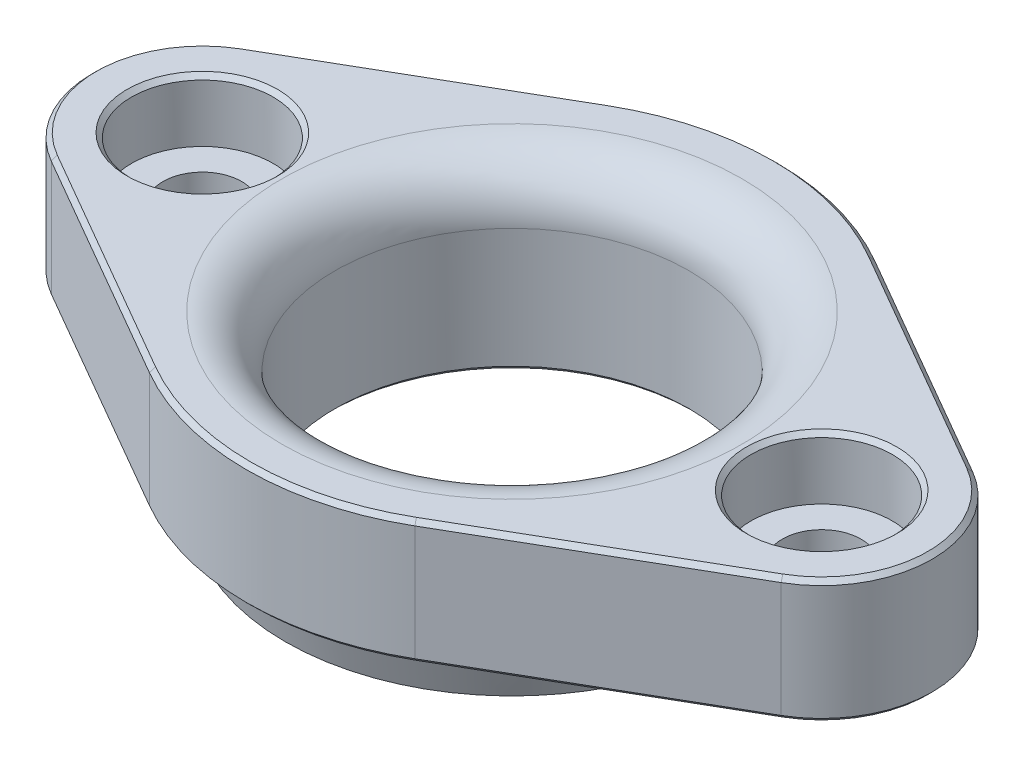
ISO-10303-21;
HEADER;
FILE_DESCRIPTION(('STEP AP214'),'2;1');
FILE_NAME('part.step','',(''),(''),'','','');
FILE_SCHEMA(('AUTOMOTIVE_DESIGN { 1 0 10303 214 1 1 1 1 }'));
ENDSEC;
DATA;
#1=APPLICATION_CONTEXT('core data for automotive mechanical design processes');
#2=APPLICATION_PROTOCOL_DEFINITION('international standard','automotive_design',2000,#1);
#3=PRODUCT_CONTEXT('',#1,'mechanical');
#4=PRODUCT('Part','Part','',(#3));
#5=PRODUCT_RELATED_PRODUCT_CATEGORY('part','',(#4));
#6=PRODUCT_DEFINITION_FORMATION('','',#4);
#7=PRODUCT_DEFINITION_CONTEXT('part definition',#1,'design');
#8=PRODUCT_DEFINITION('design','',#6,#7);
#9=PRODUCT_DEFINITION_SHAPE('','',#8);
#10=(LENGTH_UNIT() NAMED_UNIT(*) SI_UNIT(.MILLI.,.METRE.));
#11=(NAMED_UNIT(*) PLANE_ANGLE_UNIT() SI_UNIT($,.RADIAN.));
#12=(NAMED_UNIT(*) SI_UNIT($,.STERADIAN.) SOLID_ANGLE_UNIT());
#13=UNCERTAINTY_MEASURE_WITH_UNIT(LENGTH_MEASURE(1.E-05),#10,'distance_accuracy_value','');
#14=(GEOMETRIC_REPRESENTATION_CONTEXT(3) GLOBAL_UNCERTAINTY_ASSIGNED_CONTEXT((#13)) GLOBAL_UNIT_ASSIGNED_CONTEXT((#10,
#11,#12)) REPRESENTATION_CONTEXT('',''));
#15=CARTESIAN_POINT('',(0.,0.,0.));
#16=DIRECTION('',(0.,0.,1.));
#17=DIRECTION('',(1.,0.,0.));
#18=AXIS2_PLACEMENT_3D('',#15,#16,#17);
#19=CARTESIAN_POINT('',(-5.08,5.08,0.));
#20=DIRECTION('',(0.,-1.,0.));
#21=DIRECTION('',(0.,0.,-1.));
#22=AXIS2_PLACEMENT_3D('',#19,#20,#21);
#23=PLANE('',#22);
#24=CARTESIAN_POINT('',(0.,5.08,0.));
#25=DIRECTION('',(0.,-1.,0.));
#26=DIRECTION('',(0.,0.,-1.));
#27=AXIS2_PLACEMENT_3D('',#24,#25,#26);
#28=CIRCLE('',#27,7.493);
#29=CARTESIAN_POINT('',(-3.7465,5.08,6.4891283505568));
#30=VERTEX_POINT('',#29);
#31=CARTESIAN_POINT('',(3.7465,5.08,6.4891283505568));
#32=VERTEX_POINT('',#31);
#33=EDGE_CURVE('E61',#30,#32,#28,.F.);
#34=ORIENTED_EDGE('',*,*,#33,.T.);
#35=DIRECTION('',(0.866025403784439,0.,-0.5));
#36=VECTOR('',#35,1.);
#37=CARTESIAN_POINT('',(10.414,5.08,2.63964543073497));
#38=LINE('',#37,#36);
#39=CARTESIAN_POINT('',(10.414,5.08,2.63964543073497));
#40=VERTEX_POINT('',#39);
#41=EDGE_CURVE('E313',#32,#40,#38,.T.);
#42=ORIENTED_EDGE('',*,*,#41,.T.);
#43=CARTESIAN_POINT('',(8.89,5.08,0.));
#44=DIRECTION('',(0.,-1.,0.));
#45=DIRECTION('',(0.,0.,-1.));
#46=AXIS2_PLACEMENT_3D('',#43,#44,#45);
#47=CIRCLE('',#46,3.048);
#48=CARTESIAN_POINT('',(10.414,5.08,-2.63964543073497));
#49=VERTEX_POINT('',#48);
#50=EDGE_CURVE('E294',#40,#49,#47,.F.);
#51=ORIENTED_EDGE('',*,*,#50,.T.);
#52=DIRECTION('',(-0.866025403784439,0.,-0.5));
#53=VECTOR('',#52,1.);
#54=CARTESIAN_POINT('',(3.7465,5.08,-6.4891283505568));
#55=LINE('',#54,#53);
#56=CARTESIAN_POINT('',(3.7465,5.08,-6.4891283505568));
#57=VERTEX_POINT('',#56);
#58=EDGE_CURVE('E297',#49,#57,#55,.T.);
#59=ORIENTED_EDGE('',*,*,#58,.T.);
#60=CARTESIAN_POINT('',(0.,5.08,0.));
#61=DIRECTION('',(0.,-1.,0.));
#62=DIRECTION('',(0.,0.,-1.));
#63=AXIS2_PLACEMENT_3D('',#60,#61,#62);
#64=CIRCLE('',#63,7.493);
#65=CARTESIAN_POINT('',(-3.7465,5.08,-6.4891283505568));
#66=VERTEX_POINT('',#65);
#67=EDGE_CURVE('E300',#57,#66,#64,.F.);
#68=ORIENTED_EDGE('',*,*,#67,.T.);
#69=DIRECTION('',(-0.866025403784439,0.,0.5));
#70=VECTOR('',#69,1.);
#71=CARTESIAN_POINT('',(-10.414,5.08,-2.63964543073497));
#72=LINE('',#71,#70);
#73=CARTESIAN_POINT('',(-10.414,5.08,-2.63964543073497));
#74=VERTEX_POINT('',#73);
#75=EDGE_CURVE('E303',#66,#74,#72,.T.);
#76=ORIENTED_EDGE('',*,*,#75,.T.);
#77=CARTESIAN_POINT('',(-8.89,5.08,0.));
#78=DIRECTION('',(0.,-1.,0.));
#79=DIRECTION('',(0.,0.,-1.));
#80=AXIS2_PLACEMENT_3D('',#77,#78,#79);
#81=CIRCLE('',#80,3.048);
#82=CARTESIAN_POINT('',(-10.414,5.08,2.63964543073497));
#83=VERTEX_POINT('',#82);
#84=EDGE_CURVE('E306',#74,#83,#81,.F.);
#85=ORIENTED_EDGE('',*,*,#84,.T.);
#86=DIRECTION('',(0.866025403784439,0.,0.5));
#87=VECTOR('',#86,1.);
#88=CARTESIAN_POINT('',(-3.7465,5.08,6.4891283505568));
#89=LINE('',#88,#87);
#90=EDGE_CURVE('E66',#83,#30,#89,.T.);
#91=ORIENTED_EDGE('',*,*,#90,.T.);
#92=EDGE_LOOP('',(#34,#42,#51,#59,#68,#76,#85,#91));
#93=FACE_BOUND('',#92,.T.);
#94=CARTESIAN_POINT('',(-8.89,5.08,0.));
#95=DIRECTION('',(0.,-1.,0.));
#96=DIRECTION('',(0.,0.,-1.));
#97=AXIS2_PLACEMENT_3D('',#94,#95,#96);
#98=CIRCLE('',#97,2.159);
#99=CARTESIAN_POINT('',(-8.89,5.08,-2.159));
#100=VERTEX_POINT('',#99);
#101=EDGE_CURVE('E290',#100,#100,#98,.T.);
#102=ORIENTED_EDGE('',*,*,#101,.T.);
#103=EDGE_LOOP('',(#102));
#104=FACE_BOUND('',#103,.T.);
#105=CARTESIAN_POINT('',(8.89,5.08,0.));
#106=DIRECTION('',(0.,-1.,0.));
#107=DIRECTION('',(0.,0.,-1.));
#108=AXIS2_PLACEMENT_3D('',#105,#106,#107);
#109=CIRCLE('',#108,2.159);
#110=CARTESIAN_POINT('',(8.89,5.08,-2.159));
#111=VERTEX_POINT('',#110);
#112=EDGE_CURVE('E286',#111,#111,#109,.T.);
#113=ORIENTED_EDGE('',*,*,#112,.T.);
#114=EDGE_LOOP('',(#113));
#115=FACE_BOUND('',#114,.T.);
#116=CARTESIAN_POINT('',(0.,5.08,0.));
#117=DIRECTION('',(0.,-1.,0.));
#118=DIRECTION('',(0.,0.,-1.));
#119=AXIS2_PLACEMENT_3D('',#116,#117,#118);
#120=CIRCLE('',#119,6.604);
#121=CARTESIAN_POINT('',(0.,5.08,-6.604));
#122=VERTEX_POINT('',#121);
#123=EDGE_CURVE('E432',#122,#122,#120,.T.);
#124=ORIENTED_EDGE('',*,*,#123,.T.);
#125=EDGE_LOOP('',(#124));
#126=FACE_BOUND('',#125,.T.);
#127=ADVANCED_FACE('F43',(#93,#104,#115,#126),#23,.F.);
#128=CARTESIAN_POINT('',(-12.065,1.524,0.));
#129=DIRECTION('',(0.,1.,0.));
#130=DIRECTION('',(0.,0.,1.));
#131=AXIS2_PLACEMENT_3D('',#128,#129,#130);
#132=PLANE('',#131);
#133=DIRECTION('',(0.866025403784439,0.,0.5));
#134=VECTOR('',#133,1.);
#135=CARTESIAN_POINT('',(10.414,1.524,-2.63964543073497));
#136=LINE('',#135,#134);
#137=CARTESIAN_POINT('',(3.7465,1.524,-6.4891283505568));
#138=VERTEX_POINT('',#137);
#139=CARTESIAN_POINT('',(10.414,1.524,-2.63964543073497));
#140=VERTEX_POINT('',#139);
#141=EDGE_CURVE('E235',#138,#140,#136,.T.);
#142=ORIENTED_EDGE('',*,*,#141,.T.);
#143=CARTESIAN_POINT('',(8.89,1.524,0.));
#144=DIRECTION('',(0.,1.,0.));
#145=DIRECTION('',(0.,0.,1.));
#146=AXIS2_PLACEMENT_3D('',#143,#144,#145);
#147=CIRCLE('',#146,3.048);
#148=CARTESIAN_POINT('',(10.414,1.524,2.63964543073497));
#149=VERTEX_POINT('',#148);
#150=EDGE_CURVE('E238',#140,#149,#147,.F.);
#151=ORIENTED_EDGE('',*,*,#150,.T.);
#152=DIRECTION('',(-0.866025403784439,0.,0.5));
#153=VECTOR('',#152,1.);
#154=CARTESIAN_POINT('',(3.7465,1.524,6.4891283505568));
#155=LINE('',#154,#153);
#156=CARTESIAN_POINT('',(3.7465,1.524,6.4891283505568));
#157=VERTEX_POINT('',#156);
#158=EDGE_CURVE('E191',#149,#157,#155,.T.);
#159=ORIENTED_EDGE('',*,*,#158,.T.);
#160=CARTESIAN_POINT('',(0.,1.524,0.));
#161=DIRECTION('',(0.,1.,0.));
#162=DIRECTION('',(0.,0.,1.));
#163=AXIS2_PLACEMENT_3D('',#160,#161,#162);
#164=CIRCLE('',#163,7.493);
#165=CARTESIAN_POINT('',(-3.7465,1.524,6.4891283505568));
#166=VERTEX_POINT('',#165);
#167=EDGE_CURVE('E220',#157,#166,#164,.F.);
#168=ORIENTED_EDGE('',*,*,#167,.T.);
#169=DIRECTION('',(-0.866025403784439,0.,-0.5));
#170=VECTOR('',#169,1.);
#171=CARTESIAN_POINT('',(-10.414,1.524,2.63964543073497));
#172=LINE('',#171,#170);
#173=CARTESIAN_POINT('',(-10.414,1.524,2.63964543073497));
#174=VERTEX_POINT('',#173);
#175=EDGE_CURVE('E223',#166,#174,#172,.T.);
#176=ORIENTED_EDGE('',*,*,#175,.T.);
#177=CARTESIAN_POINT('',(-8.89,1.524,0.));
#178=DIRECTION('',(0.,1.,0.));
#179=DIRECTION('',(0.,0.,1.));
#180=AXIS2_PLACEMENT_3D('',#177,#178,#179);
#181=CIRCLE('',#180,3.048);
#182=CARTESIAN_POINT('',(-10.414,1.524,-2.63964543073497));
#183=VERTEX_POINT('',#182);
#184=EDGE_CURVE('E226',#174,#183,#181,.F.);
#185=ORIENTED_EDGE('',*,*,#184,.T.);
#186=DIRECTION('',(0.866025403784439,0.,-0.5));
#187=VECTOR('',#186,1.);
#188=CARTESIAN_POINT('',(-3.7465,1.524,-6.4891283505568));
#189=LINE('',#188,#187);
#190=CARTESIAN_POINT('',(-3.7465,1.524,-6.4891283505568));
#191=VERTEX_POINT('',#190);
#192=EDGE_CURVE('E229',#183,#191,#189,.T.);
#193=ORIENTED_EDGE('',*,*,#192,.T.);
#194=CARTESIAN_POINT('',(0.,1.524,0.));
#195=DIRECTION('',(0.,1.,0.));
#196=DIRECTION('',(0.,0.,1.));
#197=AXIS2_PLACEMENT_3D('',#194,#195,#196);
#198=CIRCLE('',#197,7.493);
#199=EDGE_CURVE('E232',#191,#138,#198,.F.);
#200=ORIENTED_EDGE('',*,*,#199,.T.);
#201=EDGE_LOOP('',(#142,#151,#159,#168,#176,#185,#193,#200));
#202=FACE_BOUND('',#201,.T.);
#203=CARTESIAN_POINT('',(-8.89,1.524,0.));
#204=DIRECTION('',(0.,1.,0.));
#205=DIRECTION('',(0.,0.,1.));
#206=AXIS2_PLACEMENT_3D('',#203,#204,#205);
#207=CIRCLE('',#206,1.2573);
#208=CARTESIAN_POINT('',(-8.89,1.524,1.2573));
#209=VERTEX_POINT('',#208);
#210=EDGE_CURVE('E208',#209,#209,#207,.T.);
#211=ORIENTED_EDGE('',*,*,#210,.T.);
#212=EDGE_LOOP('',(#211));
#213=FACE_BOUND('',#212,.T.);
#214=CARTESIAN_POINT('',(8.89,1.524,0.));
#215=DIRECTION('',(0.,1.,0.));
#216=DIRECTION('',(0.,0.,1.));
#217=AXIS2_PLACEMENT_3D('',#214,#215,#216);
#218=CIRCLE('',#217,1.2573);
#219=CARTESIAN_POINT('',(8.89,1.524,1.2573));
#220=VERTEX_POINT('',#219);
#221=EDGE_CURVE('E203',#220,#220,#218,.T.);
#222=ORIENTED_EDGE('',*,*,#221,.T.);
#223=EDGE_LOOP('',(#222));
#224=FACE_BOUND('',#223,.T.);
#225=CARTESIAN_POINT('',(0.,1.524,0.));
#226=DIRECTION('',(0.,1.,0.));
#227=DIRECTION('',(0.,0.,1.));
#228=AXIS2_PLACEMENT_3D('',#225,#226,#227);
#229=CIRCLE('',#228,7.27515667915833);
#230=CARTESIAN_POINT('',(0.,1.524,7.27515667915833));
#231=VERTEX_POINT('',#230);
#232=EDGE_CURVE('E428',#231,#231,#229,.T.);
#233=ORIENTED_EDGE('',*,*,#232,.T.);
#234=EDGE_LOOP('',(#233));
#235=FACE_BOUND('',#234,.T.);
#236=ADVANCED_FACE('F477',(#202,#213,#224,#235),#132,.F.);
#237=CARTESIAN_POINT('',(-6.477,0.,0.));
#238=DIRECTION('',(0.,1.,0.));
#239=DIRECTION('',(0.,0.,1.));
#240=AXIS2_PLACEMENT_3D('',#237,#238,#239);
#241=PLANE('',#240);
#242=CARTESIAN_POINT('',(0.,0.,0.));
#243=DIRECTION('',(0.,1.,0.));
#244=DIRECTION('',(0.,0.,1.));
#245=AXIS2_PLACEMENT_3D('',#242,#243,#244);
#246=CIRCLE('',#245,6.29739487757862);
#247=CARTESIAN_POINT('',(0.,0.,6.29739487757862));
#248=VERTEX_POINT('',#247);
#249=EDGE_CURVE('E444',#248,#248,#246,.F.);
#250=ORIENTED_EDGE('',*,*,#249,.T.);
#251=EDGE_LOOP('',(#250));
#252=FACE_BOUND('',#251,.T.);
#253=CARTESIAN_POINT('',(0.,0.,0.));
#254=DIRECTION('',(0.,1.,0.));
#255=DIRECTION('',(0.,0.,1.));
#256=AXIS2_PLACEMENT_3D('',#253,#254,#255);
#257=CIRCLE('',#256,5.20699999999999);
#258=CARTESIAN_POINT('',(0.,0.,5.20699999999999));
#259=VERTEX_POINT('',#258);
#260=EDGE_CURVE('E440',#259,#259,#257,.T.);
#261=ORIENTED_EDGE('',*,*,#260,.T.);
#262=EDGE_LOOP('',(#261));
#263=FACE_BOUND('',#262,.T.);
#264=ADVANCED_FACE('F482',(#252,#263),#241,.F.);
#265=CARTESIAN_POINT('',(0.,0.,0.));
#266=DIRECTION('',(0.,-1.,0.));
#267=DIRECTION('',(0.,0.,-1.));
#268=AXIS2_PLACEMENT_3D('',#265,#266,#267);
#269=CYLINDRICAL_SURFACE('',#268,5.08);
#270=CARTESIAN_POINT('',(0.,0.126999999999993,0.));
#271=DIRECTION('',(0.,1.,0.));
#272=DIRECTION('',(0.,0.,1.));
#273=AXIS2_PLACEMENT_3D('',#270,#271,#272);
#274=CIRCLE('',#273,5.08);
#275=CARTESIAN_POINT('',(0.,0.126999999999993,5.08));
#276=VERTEX_POINT('',#275);
#277=EDGE_CURVE('E211',#276,#276,#274,.F.);
#278=ORIENTED_EDGE('',*,*,#277,.T.);
#279=EDGE_LOOP('',(#278));
#280=FACE_BOUND('',#279,.T.);
#281=CARTESIAN_POINT('',(0.,3.556,0.));
#282=DIRECTION('',(0.,-1.,0.));
#283=DIRECTION('',(0.,0.,-1.));
#284=AXIS2_PLACEMENT_3D('',#281,#282,#283);
#285=CIRCLE('',#284,5.08);
#286=CARTESIAN_POINT('',(0.,3.556,-5.08));
#287=VERTEX_POINT('',#286);
#288=EDGE_CURVE('E436',#287,#287,#285,.F.);
#289=ORIENTED_EDGE('',*,*,#288,.T.);
#290=EDGE_LOOP('',(#289));
#291=FACE_BOUND('',#290,.T.);
#292=ADVANCED_FACE('F455',(#280,#291),#269,.F.);
#293=CARTESIAN_POINT('',(0.,1.524,0.));
#294=DIRECTION('',(0.,1.,0.));
#295=DIRECTION('',(0.,0.,1.));
#296=AXIS2_PLACEMENT_3D('',#293,#294,#295);
#297=CONICAL_SURFACE('',#296,6.88535456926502,0.261799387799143);
#298=CARTESIAN_POINT('',(0.,0.122672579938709,0.));
#299=DIRECTION('',(0.,-1.,0.));
#300=DIRECTION('',(0.,0.,-1.));
#301=AXIS2_PLACEMENT_3D('',#298,#299,#300);
#302=CIRCLE('',#301,6.50987001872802);
#303=CARTESIAN_POINT('',(0.,0.122672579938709,-6.50987001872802));
#304=VERTEX_POINT('',#303);
#305=EDGE_CURVE('E448',#304,#304,#302,.F.);
#306=ORIENTED_EDGE('',*,*,#305,.T.);
#307=EDGE_LOOP('',(#306));
#308=FACE_BOUND('',#307,.T.);
#309=CARTESIAN_POINT('',(0.,1.14748007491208,0.));
#310=DIRECTION('',(0.,1.,0.));
#311=DIRECTION('',(0.,0.,1.));
#312=AXIS2_PLACEMENT_3D('',#309,#310,#311);
#313=CIRCLE('',#312,6.78446635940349);
#314=CARTESIAN_POINT('',(0.,1.14748007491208,6.78446635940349));
#315=VERTEX_POINT('',#314);
#316=EDGE_CURVE('E424',#315,#315,#313,.F.);
#317=ORIENTED_EDGE('',*,*,#316,.T.);
#318=EDGE_LOOP('',(#317));
#319=FACE_BOUND('',#318,.T.);
#320=ADVANCED_FACE('F490',(#308,#319),#297,.T.);
#321=CARTESIAN_POINT('',(0.,1.016,0.));
#322=DIRECTION('',(0.,1.,0.));
#323=DIRECTION('',(0.,0.,1.));
#324=AXIS2_PLACEMENT_3D('',#321,#322,#323);
#325=TOROIDAL_SURFACE('',#324,7.27515667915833,0.508);
#326=ORIENTED_EDGE('',*,*,#232,.F.);
#327=EDGE_LOOP('',(#326));
#328=FACE_BOUND('',#327,.T.);
#329=ORIENTED_EDGE('',*,*,#316,.F.);
#330=EDGE_LOOP('',(#329));
#331=FACE_BOUND('',#330,.T.);
#332=ADVANCED_FACE('F494',(#328,#331),#325,.F.);
#333=CARTESIAN_POINT('',(0.,3.556,0.));
#334=DIRECTION('',(0.,-1.,0.));
#335=DIRECTION('',(0.,0.,-1.));
#336=AXIS2_PLACEMENT_3D('',#333,#334,#335);
#337=TOROIDAL_SURFACE('',#336,6.604,1.524);
#338=ORIENTED_EDGE('',*,*,#288,.F.);
#339=EDGE_LOOP('',(#338));
#340=FACE_BOUND('',#339,.T.);
#341=ORIENTED_EDGE('',*,*,#123,.F.);
#342=EDGE_LOOP('',(#341));
#343=FACE_BOUND('',#342,.T.);
#344=ADVANCED_FACE('F497',(#340,#343),#337,.T.);
#345=CARTESIAN_POINT('',(-8.89,5.08,0.));
#346=DIRECTION('',(0.,1.,0.));
#347=DIRECTION('',(0.,0.,1.));
#348=AXIS2_PLACEMENT_3D('',#345,#346,#347);
#349=CYLINDRICAL_SURFACE('',#348,1.1303);
#350=CARTESIAN_POINT('',(-8.89,1.651,0.));
#351=DIRECTION('',(0.,1.,0.));
#352=DIRECTION('',(0.,0.,1.));
#353=AXIS2_PLACEMENT_3D('',#350,#351,#352);
#354=CIRCLE('',#353,1.1303);
#355=CARTESIAN_POINT('',(-8.89,1.651,1.1303));
#356=VERTEX_POINT('',#355);
#357=EDGE_CURVE('E173',#356,#356,#354,.F.);
#358=ORIENTED_EDGE('',*,*,#357,.T.);
#359=EDGE_LOOP('',(#358));
#360=FACE_BOUND('',#359,.T.);
#361=CARTESIAN_POINT('',(-8.89,3.302,0.));
#362=DIRECTION('',(0.,1.,0.));
#363=DIRECTION('',(0.,0.,1.));
#364=AXIS2_PLACEMENT_3D('',#361,#362,#363);
#365=CIRCLE('',#364,1.1303);
#366=CARTESIAN_POINT('',(-8.89,3.302,1.1303));
#367=VERTEX_POINT('',#366);
#368=EDGE_CURVE('E420',#367,#367,#365,.T.);
#369=ORIENTED_EDGE('',*,*,#368,.T.);
#370=EDGE_LOOP('',(#369));
#371=FACE_BOUND('',#370,.T.);
#372=ADVANCED_FACE('F500',(#360,#371),#349,.F.);
#373=CARTESIAN_POINT('',(-7.7597,3.302,0.));
#374=DIRECTION('',(0.,-1.,0.));
#375=DIRECTION('',(0.,0.,-1.));
#376=AXIS2_PLACEMENT_3D('',#373,#374,#375);
#377=PLANE('',#376);
#378=ORIENTED_EDGE('',*,*,#368,.F.);
#379=EDGE_LOOP('',(#378));
#380=FACE_BOUND('',#379,.T.);
#381=CARTESIAN_POINT('',(-8.89,3.302,0.));
#382=DIRECTION('',(0.,1.,0.));
#383=DIRECTION('',(0.,0.,1.));
#384=AXIS2_PLACEMENT_3D('',#381,#382,#383);
#385=CIRCLE('',#384,2.032);
#386=CARTESIAN_POINT('',(-8.89,3.302,2.032));
#387=VERTEX_POINT('',#386);
#388=EDGE_CURVE('E416',#387,#387,#385,.T.);
#389=ORIENTED_EDGE('',*,*,#388,.T.);
#390=EDGE_LOOP('',(#389));
#391=FACE_BOUND('',#390,.T.);
#392=ADVANCED_FACE('F505',(#380,#391),#377,.F.);
#393=CARTESIAN_POINT('',(-8.89,5.08,0.));
#394=DIRECTION('',(0.,1.,0.));
#395=DIRECTION('',(0.,0.,1.));
#396=AXIS2_PLACEMENT_3D('',#393,#394,#395);
#397=CYLINDRICAL_SURFACE('',#396,2.032);
#398=CARTESIAN_POINT('',(-8.89,4.953,0.));
#399=DIRECTION('',(0.,-1.,0.));
#400=DIRECTION('',(0.,0.,-1.));
#401=AXIS2_PLACEMENT_3D('',#398,#399,#400);
#402=CIRCLE('',#401,2.032);
#403=CARTESIAN_POINT('',(-8.89,4.953,-2.032));
#404=VERTEX_POINT('',#403);
#405=EDGE_CURVE('E53',#404,#404,#402,.F.);
#406=ORIENTED_EDGE('',*,*,#405,.T.);
#407=EDGE_LOOP('',(#406));
#408=FACE_BOUND('',#407,.T.);
#409=ORIENTED_EDGE('',*,*,#388,.F.);
#410=EDGE_LOOP('',(#409));
#411=FACE_BOUND('',#410,.T.);
#412=ADVANCED_FACE('F515',(#408,#411),#397,.F.);
#413=CARTESIAN_POINT('',(8.89,5.08,0.));
#414=DIRECTION('',(0.,1.,0.));
#415=DIRECTION('',(0.,0.,1.));
#416=AXIS2_PLACEMENT_3D('',#413,#414,#415);
#417=CYLINDRICAL_SURFACE('',#416,1.1303);
#418=CARTESIAN_POINT('',(8.89,1.651,0.));
#419=DIRECTION('',(0.,1.,0.));
#420=DIRECTION('',(0.,0.,1.));
#421=AXIS2_PLACEMENT_3D('',#418,#419,#420);
#422=CIRCLE('',#421,1.1303);
#423=CARTESIAN_POINT('',(8.89,1.651,1.1303));
#424=VERTEX_POINT('',#423);
#425=EDGE_CURVE('E282',#424,#424,#422,.F.);
#426=ORIENTED_EDGE('',*,*,#425,.T.);
#427=EDGE_LOOP('',(#426));
#428=FACE_BOUND('',#427,.T.);
#429=CARTESIAN_POINT('',(8.89,3.302,0.));
#430=DIRECTION('',(0.,1.,0.));
#431=DIRECTION('',(0.,0.,1.));
#432=AXIS2_PLACEMENT_3D('',#429,#430,#431);
#433=CIRCLE('',#432,1.1303);
#434=CARTESIAN_POINT('',(8.89,3.302,1.1303));
#435=VERTEX_POINT('',#434);
#436=EDGE_CURVE('E412',#435,#435,#433,.T.);
#437=ORIENTED_EDGE('',*,*,#436,.T.);
#438=EDGE_LOOP('',(#437));
#439=FACE_BOUND('',#438,.T.);
#440=ADVANCED_FACE('F555',(#428,#439),#417,.F.);
#441=CARTESIAN_POINT('',(10.0203,3.302,0.));
#442=DIRECTION('',(0.,-1.,0.));
#443=DIRECTION('',(0.,0.,-1.));
#444=AXIS2_PLACEMENT_3D('',#441,#442,#443);
#445=PLANE('',#444);
#446=ORIENTED_EDGE('',*,*,#436,.F.);
#447=EDGE_LOOP('',(#446));
#448=FACE_BOUND('',#447,.T.);
#449=CARTESIAN_POINT('',(8.89,3.302,0.));
#450=DIRECTION('',(0.,1.,0.));
#451=DIRECTION('',(0.,0.,1.));
#452=AXIS2_PLACEMENT_3D('',#449,#450,#451);
#453=CIRCLE('',#452,2.032);
#454=CARTESIAN_POINT('',(8.89,3.302,2.032));
#455=VERTEX_POINT('',#454);
#456=EDGE_CURVE('E186',#455,#455,#453,.T.);
#457=ORIENTED_EDGE('',*,*,#456,.T.);
#458=EDGE_LOOP('',(#457));
#459=FACE_BOUND('',#458,.T.);
#460=ADVANCED_FACE('F563',(#448,#459),#445,.F.);
#461=CARTESIAN_POINT('',(8.89,5.08,0.));
#462=DIRECTION('',(0.,1.,0.));
#463=DIRECTION('',(0.,0.,1.));
#464=AXIS2_PLACEMENT_3D('',#461,#462,#463);
#465=CYLINDRICAL_SURFACE('',#464,2.032);
#466=CARTESIAN_POINT('',(8.89,4.953,0.));
#467=DIRECTION('',(0.,-1.,0.));
#468=DIRECTION('',(0.,0.,-1.));
#469=AXIS2_PLACEMENT_3D('',#466,#467,#468);
#470=CIRCLE('',#469,2.032);
#471=CARTESIAN_POINT('',(8.89,4.953,-2.032));
#472=VERTEX_POINT('',#471);
#473=EDGE_CURVE('E13',#472,#472,#470,.F.);
#474=ORIENTED_EDGE('',*,*,#473,.T.);
#475=EDGE_LOOP('',(#474));
#476=FACE_BOUND('',#475,.T.);
#477=ORIENTED_EDGE('',*,*,#456,.F.);
#478=EDGE_LOOP('',(#477));
#479=FACE_BOUND('',#478,.T.);
#480=ADVANCED_FACE('F572',(#476,#479),#465,.F.);
#481=CARTESIAN_POINT('',(8.89,0.,0.));
#482=DIRECTION('',(0.,1.,0.));
#483=DIRECTION('',(0.,0.,1.));
#484=AXIS2_PLACEMENT_3D('',#481,#482,#483);
#485=CYLINDRICAL_SURFACE('',#484,3.175);
#486=DIRECTION('',(0.,1.,0.));
#487=VECTOR('',#486,1.);
#488=CARTESIAN_POINT('',(10.4775,0.,2.74963065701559));
#489=LINE('',#488,#487);
#490=CARTESIAN_POINT('',(10.4775,1.651,2.74963065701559));
#491=VERTEX_POINT('',#490);
#492=CARTESIAN_POINT('',(10.4775,4.95300000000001,2.74963065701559));
#493=VERTEX_POINT('',#492);
#494=EDGE_CURVE('E164',#491,#493,#489,.T.);
#495=ORIENTED_EDGE('',*,*,#494,.F.);
#496=CARTESIAN_POINT('',(8.89,1.651,0.));
#497=DIRECTION('',(0.,1.,0.));
#498=DIRECTION('',(0.,0.,1.));
#499=AXIS2_PLACEMENT_3D('',#496,#497,#498);
#500=CIRCLE('',#499,3.175);
#501=CARTESIAN_POINT('',(10.4775,1.651,-2.74963065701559));
#502=VERTEX_POINT('',#501);
#503=EDGE_CURVE('E181',#491,#502,#500,.T.);
#504=ORIENTED_EDGE('',*,*,#503,.T.);
#505=DIRECTION('',(0.,1.,0.));
#506=VECTOR('',#505,1.);
#507=CARTESIAN_POINT('',(10.4775,0.,-2.74963065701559));
#508=LINE('',#507,#506);
#509=CARTESIAN_POINT('',(10.4775,4.95300000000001,-2.74963065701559));
#510=VERTEX_POINT('',#509);
#511=EDGE_CURVE('E343',#502,#510,#508,.T.);
#512=ORIENTED_EDGE('',*,*,#511,.T.);
#513=CARTESIAN_POINT('',(8.89,4.95300000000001,0.));
#514=DIRECTION('',(0.,-1.,0.));
#515=DIRECTION('',(0.,0.,-1.));
#516=AXIS2_PLACEMENT_3D('',#513,#514,#515);
#517=CIRCLE('',#516,3.175);
#518=EDGE_CURVE('E184',#510,#493,#517,.T.);
#519=ORIENTED_EDGE('',*,*,#518,.T.);
#520=EDGE_LOOP('',(#495,#504,#512,#519));
#521=FACE_BOUND('',#520,.T.);
#522=ADVANCED_FACE('F178',(#521),#485,.T.);
#523=CARTESIAN_POINT('',(3.81,0.,6.59911357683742));
#524=DIRECTION('',(0.5,0.,0.866025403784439));
#525=DIRECTION('',(0.866025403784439,0.,-0.5));
#526=AXIS2_PLACEMENT_3D('',#523,#524,#525);
#527=PLANE('',#526);
#528=DIRECTION('',(0.,1.,0.));
#529=VECTOR('',#528,1.);
#530=CARTESIAN_POINT('',(3.81,0.,6.59911357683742));
#531=LINE('',#530,#529);
#532=CARTESIAN_POINT('',(3.81,1.651,6.59911357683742));
#533=VERTEX_POINT('',#532);
#534=CARTESIAN_POINT('',(3.81,4.95300000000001,6.59911357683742));
#535=VERTEX_POINT('',#534);
#536=EDGE_CURVE('E167',#533,#535,#531,.T.);
#537=ORIENTED_EDGE('',*,*,#536,.F.);
#538=DIRECTION('',(0.866025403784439,0.,-0.5));
#539=VECTOR('',#538,1.);
#540=CARTESIAN_POINT('',(10.4775,1.651,2.74963065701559));
#541=LINE('',#540,#539);
#542=EDGE_CURVE('E160',#533,#491,#541,.T.);
#543=ORIENTED_EDGE('',*,*,#542,.T.);
#544=ORIENTED_EDGE('',*,*,#494,.T.);
#545=DIRECTION('',(-0.866025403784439,0.,0.5));
#546=VECTOR('',#545,1.);
#547=CARTESIAN_POINT('',(3.81,4.95300000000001,6.59911357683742));
#548=LINE('',#547,#546);
#549=EDGE_CURVE('E174',#493,#535,#548,.T.);
#550=ORIENTED_EDGE('',*,*,#549,.T.);
#551=EDGE_LOOP('',(#537,#543,#544,#550));
#552=FACE_BOUND('',#551,.T.);
#553=ADVANCED_FACE('F162',(#552),#527,.T.);
#554=CARTESIAN_POINT('',(0.,0.,0.));
#555=DIRECTION('',(0.,1.,0.));
#556=DIRECTION('',(0.,0.,1.));
#557=AXIS2_PLACEMENT_3D('',#554,#555,#556);
#558=CYLINDRICAL_SURFACE('',#557,7.62);
#559=DIRECTION('',(0.,1.,0.));
#560=VECTOR('',#559,1.);
#561=CARTESIAN_POINT('',(-3.81,0.,6.59911357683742));
#562=LINE('',#561,#560);
#563=CARTESIAN_POINT('',(-3.81,1.651,6.59911357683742));
#564=VERTEX_POINT('',#563);
#565=CARTESIAN_POINT('',(-3.81,4.95300000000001,6.59911357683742));
#566=VERTEX_POINT('',#565);
#567=EDGE_CURVE('E941',#564,#566,#562,.T.);
#568=ORIENTED_EDGE('',*,*,#567,.F.);
#569=CARTESIAN_POINT('',(0.,1.651,0.));
#570=DIRECTION('',(0.,1.,0.));
#571=DIRECTION('',(0.,0.,1.));
#572=AXIS2_PLACEMENT_3D('',#569,#570,#571);
#573=CIRCLE('',#572,7.62);
#574=EDGE_CURVE('E274',#564,#533,#573,.T.);
#575=ORIENTED_EDGE('',*,*,#574,.T.);
#576=ORIENTED_EDGE('',*,*,#536,.T.);
#577=CARTESIAN_POINT('',(0.,4.95300000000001,0.));
#578=DIRECTION('',(0.,-1.,0.));
#579=DIRECTION('',(0.,0.,-1.));
#580=AXIS2_PLACEMENT_3D('',#577,#578,#579);
#581=CIRCLE('',#580,7.62);
#582=EDGE_CURVE('E271',#535,#566,#581,.T.);
#583=ORIENTED_EDGE('',*,*,#582,.T.);
#584=EDGE_LOOP('',(#568,#575,#576,#583));
#585=FACE_BOUND('',#584,.T.);
#586=ADVANCED_FACE('F596',(#585),#558,.T.);
#587=CARTESIAN_POINT('',(-10.4775,0.,2.74963065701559));
#588=DIRECTION('',(-0.5,0.,0.866025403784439));
#589=DIRECTION('',(0.866025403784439,0.,0.5));
#590=AXIS2_PLACEMENT_3D('',#587,#588,#589);
#591=PLANE('',#590);
#592=DIRECTION('',(0.,1.,0.));
#593=VECTOR('',#592,1.);
#594=CARTESIAN_POINT('',(-10.4775,0.,2.74963065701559));
#595=LINE('',#594,#593);
#596=CARTESIAN_POINT('',(-10.4775,1.651,2.74963065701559));
#597=VERTEX_POINT('',#596);
#598=CARTESIAN_POINT('',(-10.4775,4.95300000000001,2.74963065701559));
#599=VERTEX_POINT('',#598);
#600=EDGE_CURVE('E402',#597,#599,#595,.T.);
#601=ORIENTED_EDGE('',*,*,#600,.F.);
#602=DIRECTION('',(0.866025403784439,0.,0.5));
#603=VECTOR('',#602,1.);
#604=CARTESIAN_POINT('',(-3.81,1.651,6.59911357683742));
#605=LINE('',#604,#603);
#606=EDGE_CURVE('E268',#597,#564,#605,.T.);
#607=ORIENTED_EDGE('',*,*,#606,.T.);
#608=ORIENTED_EDGE('',*,*,#567,.T.);
#609=DIRECTION('',(-0.866025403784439,0.,-0.5));
#610=VECTOR('',#609,1.);
#611=CARTESIAN_POINT('',(-10.4775,4.95300000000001,2.74963065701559));
#612=LINE('',#611,#610);
#613=EDGE_CURVE('E265',#566,#599,#612,.T.);
#614=ORIENTED_EDGE('',*,*,#613,.T.);
#615=EDGE_LOOP('',(#601,#607,#608,#614));
#616=FACE_BOUND('',#615,.T.);
#617=ADVANCED_FACE('F604',(#616),#591,.T.);
#618=CARTESIAN_POINT('',(-8.89,0.,0.));
#619=DIRECTION('',(0.,1.,0.));
#620=DIRECTION('',(0.,0.,1.));
#621=AXIS2_PLACEMENT_3D('',#618,#619,#620);
#622=CYLINDRICAL_SURFACE('',#621,3.175);
#623=DIRECTION('',(0.,1.,0.));
#624=VECTOR('',#623,1.);
#625=CARTESIAN_POINT('',(-10.4775,0.,-2.74963065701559));
#626=LINE('',#625,#624);
#627=CARTESIAN_POINT('',(-10.4775,1.651,-2.74963065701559));
#628=VERTEX_POINT('',#627);
#629=CARTESIAN_POINT('',(-10.4775,4.95300000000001,-2.74963065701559));
#630=VERTEX_POINT('',#629);
#631=EDGE_CURVE('E392',#628,#630,#626,.T.);
#632=ORIENTED_EDGE('',*,*,#631,.F.);
#633=CARTESIAN_POINT('',(-8.89,1.651,0.));
#634=DIRECTION('',(0.,1.,0.));
#635=DIRECTION('',(0.,0.,1.));
#636=AXIS2_PLACEMENT_3D('',#633,#634,#635);
#637=CIRCLE('',#636,3.175);
#638=EDGE_CURVE('E262',#628,#597,#637,.T.);
#639=ORIENTED_EDGE('',*,*,#638,.T.);
#640=ORIENTED_EDGE('',*,*,#600,.T.);
#641=CARTESIAN_POINT('',(-8.89,4.95300000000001,0.));
#642=DIRECTION('',(0.,-1.,0.));
#643=DIRECTION('',(0.,0.,-1.));
#644=AXIS2_PLACEMENT_3D('',#641,#642,#643);
#645=CIRCLE('',#644,3.175);
#646=EDGE_CURVE('E259',#599,#630,#645,.T.);
#647=ORIENTED_EDGE('',*,*,#646,.T.);
#648=EDGE_LOOP('',(#632,#639,#640,#647));
#649=FACE_BOUND('',#648,.T.);
#650=ADVANCED_FACE('F613',(#649),#622,.T.);
#651=CARTESIAN_POINT('',(-10.4775,0.,-2.74963065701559));
#652=DIRECTION('',(-0.5,0.,-0.866025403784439));
#653=DIRECTION('',(-0.866025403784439,0.,0.5));
#654=AXIS2_PLACEMENT_3D('',#651,#652,#653);
#655=PLANE('',#654);
#656=DIRECTION('',(0.,1.,0.));
#657=VECTOR('',#656,1.);
#658=CARTESIAN_POINT('',(-3.81,0.,-6.59911357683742));
#659=LINE('',#658,#657);
#660=CARTESIAN_POINT('',(-3.81,1.651,-6.59911357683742));
#661=VERTEX_POINT('',#660);
#662=CARTESIAN_POINT('',(-3.81,4.95300000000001,-6.59911357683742));
#663=VERTEX_POINT('',#662);
#664=EDGE_CURVE('E389',#661,#663,#659,.T.);
#665=ORIENTED_EDGE('',*,*,#664,.F.);
#666=DIRECTION('',(-0.866025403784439,0.,0.5));
#667=VECTOR('',#666,1.);
#668=CARTESIAN_POINT('',(-10.4775,1.651,-2.74963065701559));
#669=LINE('',#668,#667);
#670=EDGE_CURVE('E256',#661,#628,#669,.T.);
#671=ORIENTED_EDGE('',*,*,#670,.T.);
#672=ORIENTED_EDGE('',*,*,#631,.T.);
#673=DIRECTION('',(0.866025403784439,0.,-0.5));
#674=VECTOR('',#673,1.);
#675=CARTESIAN_POINT('',(-3.81,4.95300000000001,-6.59911357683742));
#676=LINE('',#675,#674);
#677=EDGE_CURVE('E253',#630,#663,#676,.T.);
#678=ORIENTED_EDGE('',*,*,#677,.T.);
#679=EDGE_LOOP('',(#665,#671,#672,#678));
#680=FACE_BOUND('',#679,.T.);
#681=ADVANCED_FACE('F388',(#680),#655,.T.);
#682=CARTESIAN_POINT('',(0.,0.,0.));
#683=DIRECTION('',(0.,1.,0.));
#684=DIRECTION('',(0.,0.,1.));
#685=AXIS2_PLACEMENT_3D('',#682,#683,#684);
#686=CYLINDRICAL_SURFACE('',#685,7.62);
#687=DIRECTION('',(0.,1.,0.));
#688=VECTOR('',#687,1.);
#689=CARTESIAN_POINT('',(3.81,0.,-6.59911357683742));
#690=LINE('',#689,#688);
#691=CARTESIAN_POINT('',(3.81,1.651,-6.59911357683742));
#692=VERTEX_POINT('',#691);
#693=CARTESIAN_POINT('',(3.81,4.95300000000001,-6.59911357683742));
#694=VERTEX_POINT('',#693);
#695=EDGE_CURVE('E399',#692,#694,#690,.T.);
#696=ORIENTED_EDGE('',*,*,#695,.F.);
#697=CARTESIAN_POINT('',(0.,1.651,0.));
#698=DIRECTION('',(0.,1.,0.));
#699=DIRECTION('',(0.,0.,1.));
#700=AXIS2_PLACEMENT_3D('',#697,#698,#699);
#701=CIRCLE('',#700,7.62);
#702=EDGE_CURVE('E250',#692,#661,#701,.T.);
#703=ORIENTED_EDGE('',*,*,#702,.T.);
#704=ORIENTED_EDGE('',*,*,#664,.T.);
#705=CARTESIAN_POINT('',(0.,4.95300000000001,0.));
#706=DIRECTION('',(0.,-1.,0.));
#707=DIRECTION('',(0.,0.,-1.));
#708=AXIS2_PLACEMENT_3D('',#705,#706,#707);
#709=CIRCLE('',#708,7.62);
#710=EDGE_CURVE('E247',#663,#694,#709,.T.);
#711=ORIENTED_EDGE('',*,*,#710,.T.);
#712=EDGE_LOOP('',(#696,#703,#704,#711));
#713=FACE_BOUND('',#712,.T.);
#714=ADVANCED_FACE('F395',(#713),#686,.T.);
#715=CARTESIAN_POINT('',(10.4775,0.,-2.74963065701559));
#716=DIRECTION('',(0.5,0.,-0.866025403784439));
#717=DIRECTION('',(-0.866025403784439,0.,-0.5));
#718=AXIS2_PLACEMENT_3D('',#715,#716,#717);
#719=PLANE('',#718);
#720=ORIENTED_EDGE('',*,*,#511,.F.);
#721=DIRECTION('',(-0.866025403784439,0.,-0.5));
#722=VECTOR('',#721,1.);
#723=CARTESIAN_POINT('',(3.81,1.651,-6.59911357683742));
#724=LINE('',#723,#722);
#725=EDGE_CURVE('E244',#502,#692,#724,.T.);
#726=ORIENTED_EDGE('',*,*,#725,.T.);
#727=ORIENTED_EDGE('',*,*,#695,.T.);
#728=DIRECTION('',(0.866025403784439,0.,0.5));
#729=VECTOR('',#728,1.);
#730=CARTESIAN_POINT('',(10.4775,4.95300000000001,-2.74963065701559));
#731=LINE('',#730,#729);
#732=EDGE_CURVE('E241',#694,#510,#731,.T.);
#733=ORIENTED_EDGE('',*,*,#732,.T.);
#734=EDGE_LOOP('',(#720,#726,#727,#733));
#735=FACE_BOUND('',#734,.T.);
#736=ADVANCED_FACE('F471',(#735),#719,.T.);
#737=CARTESIAN_POINT('',(0.,0.,0.));
#738=DIRECTION('',(0.,1.,0.));
#739=DIRECTION('',(0.,0.,1.));
#740=AXIS2_PLACEMENT_3D('',#737,#738,#739);
#741=CONICAL_SURFACE('',#740,6.29739487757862,1.04719755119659);
#742=ORIENTED_EDGE('',*,*,#305,.F.);
#743=EDGE_LOOP('',(#742));
#744=FACE_BOUND('',#743,.T.);
#745=ORIENTED_EDGE('',*,*,#249,.F.);
#746=EDGE_LOOP('',(#745));
#747=FACE_BOUND('',#746,.T.);
#748=ADVANCED_FACE('F461',(#744,#747),#741,.T.);
#749=CARTESIAN_POINT('',(0.,0.126999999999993,0.));
#750=DIRECTION('',(0.,-1.,0.));
#751=DIRECTION('',(0.,0.,-1.));
#752=AXIS2_PLACEMENT_3D('',#749,#750,#751);
#753=CONICAL_SURFACE('',#752,5.08,0.785398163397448);
#754=ORIENTED_EDGE('',*,*,#260,.F.);
#755=EDGE_LOOP('',(#754));
#756=FACE_BOUND('',#755,.T.);
#757=ORIENTED_EDGE('',*,*,#277,.F.);
#758=EDGE_LOOP('',(#757));
#759=FACE_BOUND('',#758,.T.);
#760=ADVANCED_FACE('F458',(#756,#759),#753,.F.);
#761=CARTESIAN_POINT('',(-8.89,1.651,0.));
#762=DIRECTION('',(0.,1.,0.));
#763=DIRECTION('',(0.,0.,1.));
#764=AXIS2_PLACEMENT_3D('',#761,#762,#763);
#765=CONICAL_SURFACE('',#764,3.175,0.785398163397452);
#766=DIRECTION('',(-0.353553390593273,0.707106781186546,-0.612372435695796));
#767=VECTOR('',#766,1.);
#768=CARTESIAN_POINT('',(-10.414,1.524,-2.63964543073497));
#769=LINE('',#768,#767);
#770=EDGE_CURVE('E335',#183,#628,#769,.T.);
#771=ORIENTED_EDGE('',*,*,#770,.F.);
#772=ORIENTED_EDGE('',*,*,#184,.F.);
#773=DIRECTION('',(0.353553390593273,-0.707106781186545,-0.612372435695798));
#774=VECTOR('',#773,1.);
#775=CARTESIAN_POINT('',(-10.4775,1.651,2.74963065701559));
#776=LINE('',#775,#774);
#777=EDGE_CURVE('E339',#597,#174,#776,.T.);
#778=ORIENTED_EDGE('',*,*,#777,.F.);
#779=ORIENTED_EDGE('',*,*,#638,.F.);
#780=EDGE_LOOP('',(#771,#772,#778,#779));
#781=FACE_BOUND('',#780,.T.);
#782=ADVANCED_FACE('F460',(#781),#765,.T.);
#783=CARTESIAN_POINT('',(-10.4775,1.651,2.74963065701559));
#784=DIRECTION('',(-0.353553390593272,-0.70710678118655,0.612372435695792));
#785=DIRECTION('',(-0.866025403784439,0.,-0.5));
#786=AXIS2_PLACEMENT_3D('',#783,#784,#785);
#787=PLANE('',#786);
#788=ORIENTED_EDGE('',*,*,#777,.T.);
#789=ORIENTED_EDGE('',*,*,#175,.F.);
#790=DIRECTION('',(0.353553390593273,-0.707106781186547,-0.612372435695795));
#791=VECTOR('',#790,1.);
#792=CARTESIAN_POINT('',(-3.81,1.651,6.59911357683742));
#793=LINE('',#792,#791);
#794=EDGE_CURVE('E331',#564,#166,#793,.T.);
#795=ORIENTED_EDGE('',*,*,#794,.F.);
#796=ORIENTED_EDGE('',*,*,#606,.F.);
#797=EDGE_LOOP('',(#788,#789,#795,#796));
#798=FACE_BOUND('',#797,.T.);
#799=ADVANCED_FACE('F468',(#798),#787,.T.);
#800=CARTESIAN_POINT('',(-10.4775,1.651,-2.74963065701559));
#801=DIRECTION('',(-0.353553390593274,-0.707106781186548,-0.612372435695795));
#802=DIRECTION('',(0.866025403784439,0.,-0.5));
#803=AXIS2_PLACEMENT_3D('',#800,#801,#802);
#804=PLANE('',#803);
#805=ORIENTED_EDGE('',*,*,#770,.T.);
#806=ORIENTED_EDGE('',*,*,#670,.F.);
#807=DIRECTION('',(-0.353553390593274,0.707106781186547,-0.612372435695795));
#808=VECTOR('',#807,1.);
#809=CARTESIAN_POINT('',(-3.7465,1.524,-6.4891283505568));
#810=LINE('',#809,#808);
#811=EDGE_CURVE('E327',#191,#661,#810,.T.);
#812=ORIENTED_EDGE('',*,*,#811,.F.);
#813=ORIENTED_EDGE('',*,*,#192,.F.);
#814=EDGE_LOOP('',(#805,#806,#812,#813));
#815=FACE_BOUND('',#814,.T.);
#816=ADVANCED_FACE('F665',(#815),#804,.T.);
#817=CARTESIAN_POINT('',(0.,1.651,0.));
#818=DIRECTION('',(0.,1.,0.));
#819=DIRECTION('',(0.,0.,1.));
#820=AXIS2_PLACEMENT_3D('',#817,#818,#819);
#821=CONICAL_SURFACE('',#820,7.62,0.785398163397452);
#822=ORIENTED_EDGE('',*,*,#794,.T.);
#823=ORIENTED_EDGE('',*,*,#167,.F.);
#824=DIRECTION('',(-0.353553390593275,-0.707106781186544,-0.612372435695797));
#825=VECTOR('',#824,1.);
#826=CARTESIAN_POINT('',(3.81,1.651,6.59911357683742));
#827=LINE('',#826,#825);
#828=EDGE_CURVE('E324',#533,#157,#827,.T.);
#829=ORIENTED_EDGE('',*,*,#828,.F.);
#830=ORIENTED_EDGE('',*,*,#574,.F.);
#831=EDGE_LOOP('',(#822,#823,#829,#830));
#832=FACE_BOUND('',#831,.T.);
#833=ADVANCED_FACE('F674',(#832),#821,.T.);
#834=CARTESIAN_POINT('',(0.,1.651,0.));
#835=DIRECTION('',(0.,1.,0.));
#836=DIRECTION('',(0.,0.,1.));
#837=AXIS2_PLACEMENT_3D('',#834,#835,#836);
#838=CONICAL_SURFACE('',#837,7.62,0.785398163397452);
#839=ORIENTED_EDGE('',*,*,#811,.T.);
#840=ORIENTED_EDGE('',*,*,#702,.F.);
#841=DIRECTION('',(0.353553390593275,0.707106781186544,-0.612372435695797));
#842=VECTOR('',#841,1.);
#843=CARTESIAN_POINT('',(3.7465,1.524,-6.4891283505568));
#844=LINE('',#843,#842);
#845=EDGE_CURVE('E196',#138,#692,#844,.T.);
#846=ORIENTED_EDGE('',*,*,#845,.F.);
#847=ORIENTED_EDGE('',*,*,#199,.F.);
#848=EDGE_LOOP('',(#839,#840,#846,#847));
#849=FACE_BOUND('',#848,.T.);
#850=ADVANCED_FACE('F683',(#849),#838,.T.);
#851=CARTESIAN_POINT('',(3.81,1.651,6.59911357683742));
#852=DIRECTION('',(0.353553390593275,-0.707106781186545,0.612372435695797));
#853=DIRECTION('',(-0.866025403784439,0.,0.5));
#854=AXIS2_PLACEMENT_3D('',#851,#852,#853);
#855=PLANE('',#854);
#856=ORIENTED_EDGE('',*,*,#828,.T.);
#857=ORIENTED_EDGE('',*,*,#158,.F.);
#858=DIRECTION('',(-0.353553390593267,-0.707106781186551,-0.612372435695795));
#859=VECTOR('',#858,1.);
#860=CARTESIAN_POINT('',(10.4775,1.651,2.74963065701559));
#861=LINE('',#860,#859);
#862=EDGE_CURVE('E189',#491,#149,#861,.T.);
#863=ORIENTED_EDGE('',*,*,#862,.F.);
#864=ORIENTED_EDGE('',*,*,#542,.F.);
#865=EDGE_LOOP('',(#856,#857,#863,#864));
#866=FACE_BOUND('',#865,.T.);
#867=ADVANCED_FACE('F190',(#866),#855,.T.);
#868=CARTESIAN_POINT('',(10.4775,1.651,-2.74963065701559));
#869=DIRECTION('',(0.353553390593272,-0.70710678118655,-0.612372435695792));
#870=DIRECTION('',(0.866025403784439,0.,0.5));
#871=AXIS2_PLACEMENT_3D('',#868,#869,#870);
#872=PLANE('',#871);
#873=ORIENTED_EDGE('',*,*,#845,.T.);
#874=ORIENTED_EDGE('',*,*,#725,.F.);
#875=DIRECTION('',(0.353553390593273,0.707106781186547,-0.612372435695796));
#876=VECTOR('',#875,1.);
#877=CARTESIAN_POINT('',(10.414,1.524,-2.63964543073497));
#878=LINE('',#877,#876);
#879=EDGE_CURVE('E197',#140,#502,#878,.T.);
#880=ORIENTED_EDGE('',*,*,#879,.F.);
#881=ORIENTED_EDGE('',*,*,#141,.F.);
#882=EDGE_LOOP('',(#873,#874,#880,#881));
#883=FACE_BOUND('',#882,.T.);
#884=ADVANCED_FACE('F700',(#883),#872,.T.);
#885=CARTESIAN_POINT('',(8.89,1.651,0.));
#886=DIRECTION('',(0.,1.,0.));
#887=DIRECTION('',(0.,0.,1.));
#888=AXIS2_PLACEMENT_3D('',#885,#886,#887);
#889=CONICAL_SURFACE('',#888,3.175,0.785398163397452);
#890=ORIENTED_EDGE('',*,*,#862,.T.);
#891=ORIENTED_EDGE('',*,*,#150,.F.);
#892=ORIENTED_EDGE('',*,*,#879,.T.);
#893=ORIENTED_EDGE('',*,*,#503,.F.);
#894=EDGE_LOOP('',(#890,#891,#892,#893));
#895=FACE_BOUND('',#894,.T.);
#896=ADVANCED_FACE('F199',(#895),#889,.T.);
#897=CARTESIAN_POINT('',(-8.89,1.524,0.));
#898=DIRECTION('',(0.,-1.,0.));
#899=DIRECTION('',(0.,0.,-1.));
#900=AXIS2_PLACEMENT_3D('',#897,#898,#899);
#901=CONICAL_SURFACE('',#900,1.2573,0.785398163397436);
#902=ORIENTED_EDGE('',*,*,#357,.F.);
#903=EDGE_LOOP('',(#902));
#904=FACE_BOUND('',#903,.T.);
#905=ORIENTED_EDGE('',*,*,#210,.F.);
#906=EDGE_LOOP('',(#905));
#907=FACE_BOUND('',#906,.T.);
#908=ADVANCED_FACE('F716',(#904,#907),#901,.F.);
#909=CARTESIAN_POINT('',(8.89,1.524,0.));
#910=DIRECTION('',(0.,-1.,0.));
#911=DIRECTION('',(0.,0.,-1.));
#912=AXIS2_PLACEMENT_3D('',#909,#910,#911);
#913=CONICAL_SURFACE('',#912,1.2573,0.785398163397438);
#914=ORIENTED_EDGE('',*,*,#425,.F.);
#915=EDGE_LOOP('',(#914));
#916=FACE_BOUND('',#915,.T.);
#917=ORIENTED_EDGE('',*,*,#221,.F.);
#918=EDGE_LOOP('',(#917));
#919=FACE_BOUND('',#918,.T.);
#920=ADVANCED_FACE('F723',(#916,#919),#913,.F.);
#921=CARTESIAN_POINT('',(-7.5565,5.08,-4.28942382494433));
#922=DIRECTION('',(-0.35355339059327,0.707106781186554,-0.612372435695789));
#923=DIRECTION('',(0.866025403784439,0.,-0.5));
#924=AXIS2_PLACEMENT_3D('',#921,#922,#923);
#925=PLANE('',#924);
#926=DIRECTION('',(0.353553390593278,0.707106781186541,0.6123724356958));
#927=VECTOR('',#926,1.);
#928=CARTESIAN_POINT('',(-3.81,4.95300000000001,-6.59911357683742));
#929=LINE('',#928,#927);
#930=EDGE_CURVE('E365',#663,#66,#929,.T.);
#931=ORIENTED_EDGE('',*,*,#930,.F.);
#932=ORIENTED_EDGE('',*,*,#677,.F.);
#933=DIRECTION('',(-0.353553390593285,-0.70710678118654,-0.612372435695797));
#934=VECTOR('',#933,1.);
#935=CARTESIAN_POINT('',(-10.414,5.08,-2.63964543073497));
#936=LINE('',#935,#934);
#937=EDGE_CURVE('E47',#74,#630,#936,.T.);
#938=ORIENTED_EDGE('',*,*,#937,.F.);
#939=ORIENTED_EDGE('',*,*,#75,.F.);
#940=EDGE_LOOP('',(#931,#932,#938,#939));
#941=FACE_BOUND('',#940,.T.);
#942=ADVANCED_FACE('F383',(#941),#925,.T.);
#943=CARTESIAN_POINT('',(-8.89,5.08,0.));
#944=DIRECTION('',(0.,-1.,0.));
#945=DIRECTION('',(0.,0.,-1.));
#946=AXIS2_PLACEMENT_3D('',#943,#944,#945);
#947=CONICAL_SURFACE('',#946,3.048,0.785398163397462);
#948=ORIENTED_EDGE('',*,*,#937,.T.);
#949=ORIENTED_EDGE('',*,*,#646,.F.);
#950=DIRECTION('',(-0.353553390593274,-0.707106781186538,0.612372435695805));
#951=VECTOR('',#950,1.);
#952=CARTESIAN_POINT('',(-10.414,5.08,2.63964543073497));
#953=LINE('',#952,#951);
#954=EDGE_CURVE('E362',#83,#599,#953,.T.);
#955=ORIENTED_EDGE('',*,*,#954,.F.);
#956=ORIENTED_EDGE('',*,*,#84,.F.);
#957=EDGE_LOOP('',(#948,#949,#955,#956));
#958=FACE_BOUND('',#957,.T.);
#959=ADVANCED_FACE('F378',(#958),#947,.T.);
#960=CARTESIAN_POINT('',(0.,5.08,0.));
#961=DIRECTION('',(0.,-1.,0.));
#962=DIRECTION('',(0.,0.,-1.));
#963=AXIS2_PLACEMENT_3D('',#960,#961,#962);
#964=CONICAL_SURFACE('',#963,7.493,0.785398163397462);
#965=ORIENTED_EDGE('',*,*,#930,.T.);
#966=ORIENTED_EDGE('',*,*,#67,.F.);
#967=DIRECTION('',(-0.353553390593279,0.707106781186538,0.612372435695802));
#968=VECTOR('',#967,1.);
#969=CARTESIAN_POINT('',(3.81,4.95300000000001,-6.59911357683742));
#970=LINE('',#969,#968);
#971=EDGE_CURVE('E358',#694,#57,#970,.T.);
#972=ORIENTED_EDGE('',*,*,#971,.F.);
#973=ORIENTED_EDGE('',*,*,#710,.F.);
#974=EDGE_LOOP('',(#965,#966,#972,#973));
#975=FACE_BOUND('',#974,.T.);
#976=ADVANCED_FACE('F747',(#975),#964,.T.);
#977=CARTESIAN_POINT('',(-7.5565,5.08,4.28942382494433));
#978=DIRECTION('',(-0.353553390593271,0.707106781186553,0.61237243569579));
#979=DIRECTION('',(-0.866025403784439,0.,-0.5));
#980=AXIS2_PLACEMENT_3D('',#977,#978,#979);
#981=PLANE('',#980);
#982=ORIENTED_EDGE('',*,*,#954,.T.);
#983=ORIENTED_EDGE('',*,*,#613,.F.);
#984=DIRECTION('',(-0.353553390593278,-0.707106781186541,0.6123724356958));
#985=VECTOR('',#984,1.);
#986=CARTESIAN_POINT('',(-3.7465,5.08,6.4891283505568));
#987=LINE('',#986,#985);
#988=EDGE_CURVE('E354',#30,#566,#987,.T.);
#989=ORIENTED_EDGE('',*,*,#988,.F.);
#990=ORIENTED_EDGE('',*,*,#90,.F.);
#991=EDGE_LOOP('',(#982,#983,#989,#990));
#992=FACE_BOUND('',#991,.T.);
#993=ADVANCED_FACE('F755',(#992),#981,.T.);
#994=CARTESIAN_POINT('',(-0.0635000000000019,5.08,-8.68883287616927));
#995=DIRECTION('',(0.353553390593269,0.707106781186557,-0.612372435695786));
#996=DIRECTION('',(0.866025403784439,0.,0.5));
#997=AXIS2_PLACEMENT_3D('',#994,#995,#996);
#998=PLANE('',#997);
#999=ORIENTED_EDGE('',*,*,#971,.T.);
#1000=ORIENTED_EDGE('',*,*,#58,.F.);
#1001=DIRECTION('',(-0.353553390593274,0.707106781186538,0.612372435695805));
#1002=VECTOR('',#1001,1.);
#1003=CARTESIAN_POINT('',(10.4775,4.95300000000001,-2.74963065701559));
#1004=LINE('',#1003,#1002);
#1005=EDGE_CURVE('E350',#510,#49,#1004,.T.);
#1006=ORIENTED_EDGE('',*,*,#1005,.F.);
#1007=ORIENTED_EDGE('',*,*,#732,.F.);
#1008=EDGE_LOOP('',(#999,#1000,#1006,#1007));
#1009=FACE_BOUND('',#1008,.T.);
#1010=ADVANCED_FACE('F763',(#1009),#998,.T.);
#1011=CARTESIAN_POINT('',(0.,5.08,0.));
#1012=DIRECTION('',(0.,-1.,0.));
#1013=DIRECTION('',(0.,0.,-1.));
#1014=AXIS2_PLACEMENT_3D('',#1011,#1012,#1013);
#1015=CONICAL_SURFACE('',#1014,7.493,0.785398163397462);
#1016=ORIENTED_EDGE('',*,*,#988,.T.);
#1017=ORIENTED_EDGE('',*,*,#582,.F.);
#1018=DIRECTION('',(0.353553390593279,-0.707106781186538,0.612372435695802));
#1019=VECTOR('',#1018,1.);
#1020=CARTESIAN_POINT('',(3.7465,5.08,6.4891283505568));
#1021=LINE('',#1020,#1019);
#1022=EDGE_CURVE('E347',#32,#535,#1021,.T.);
#1023=ORIENTED_EDGE('',*,*,#1022,.F.);
#1024=ORIENTED_EDGE('',*,*,#33,.F.);
#1025=EDGE_LOOP('',(#1016,#1017,#1023,#1024));
#1026=FACE_BOUND('',#1025,.T.);
#1027=ADVANCED_FACE('F772',(#1026),#1015,.T.);
#1028=CARTESIAN_POINT('',(8.89,5.08,0.));
#1029=DIRECTION('',(0.,-1.,0.));
#1030=DIRECTION('',(0.,0.,-1.));
#1031=AXIS2_PLACEMENT_3D('',#1028,#1029,#1030);
#1032=CONICAL_SURFACE('',#1031,3.048,0.785398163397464);
#1033=ORIENTED_EDGE('',*,*,#1005,.T.);
#1034=ORIENTED_EDGE('',*,*,#50,.F.);
#1035=DIRECTION('',(-0.353553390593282,0.707106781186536,-0.612372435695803));
#1036=VECTOR('',#1035,1.);
#1037=CARTESIAN_POINT('',(10.4775,4.95300000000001,2.74963065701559));
#1038=LINE('',#1037,#1036);
#1039=EDGE_CURVE('E344',#493,#40,#1038,.T.);
#1040=ORIENTED_EDGE('',*,*,#1039,.F.);
#1041=ORIENTED_EDGE('',*,*,#518,.F.);
#1042=EDGE_LOOP('',(#1033,#1034,#1040,#1041));
#1043=FACE_BOUND('',#1042,.T.);
#1044=ADVANCED_FACE('F781',(#1043),#1032,.T.);
#1045=CARTESIAN_POINT('',(-0.0634999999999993,5.08,8.68883287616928));
#1046=DIRECTION('',(0.35355339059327,0.707106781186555,0.612372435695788));
#1047=DIRECTION('',(-0.866025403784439,0.,0.5));
#1048=AXIS2_PLACEMENT_3D('',#1045,#1046,#1047);
#1049=PLANE('',#1048);
#1050=ORIENTED_EDGE('',*,*,#1022,.T.);
#1051=ORIENTED_EDGE('',*,*,#549,.F.);
#1052=ORIENTED_EDGE('',*,*,#1039,.T.);
#1053=ORIENTED_EDGE('',*,*,#41,.F.);
#1054=EDGE_LOOP('',(#1050,#1051,#1052,#1053));
#1055=FACE_BOUND('',#1054,.T.);
#1056=ADVANCED_FACE('F790',(#1055),#1049,.T.);
#1057=CARTESIAN_POINT('',(-8.89,4.953,0.));
#1058=DIRECTION('',(0.,1.,0.));
#1059=DIRECTION('',(0.,0.,1.));
#1060=AXIS2_PLACEMENT_3D('',#1057,#1058,#1059);
#1061=CONICAL_SURFACE('',#1060,2.032,0.785398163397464);
#1062=ORIENTED_EDGE('',*,*,#101,.F.);
#1063=EDGE_LOOP('',(#1062));
#1064=FACE_BOUND('',#1063,.T.);
#1065=ORIENTED_EDGE('',*,*,#405,.F.);
#1066=EDGE_LOOP('',(#1065));
#1067=FACE_BOUND('',#1066,.T.);
#1068=ADVANCED_FACE('F799',(#1064,#1067),#1061,.F.);
#1069=CARTESIAN_POINT('',(8.89,4.953,0.));
#1070=DIRECTION('',(0.,1.,0.));
#1071=DIRECTION('',(0.,0.,1.));
#1072=AXIS2_PLACEMENT_3D('',#1069,#1070,#1071);
#1073=CONICAL_SURFACE('',#1072,2.032,0.785398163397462);
#1074=ORIENTED_EDGE('',*,*,#112,.F.);
#1075=EDGE_LOOP('',(#1074));
#1076=FACE_BOUND('',#1075,.T.);
#1077=ORIENTED_EDGE('',*,*,#473,.F.);
#1078=EDGE_LOOP('',(#1077));
#1079=FACE_BOUND('',#1078,.T.);
#1080=ADVANCED_FACE('F45',(#1076,#1079),#1073,.F.);
#1081=CLOSED_SHELL('',(#127,#236,#264,#292,#320,#332,#344,#372,#392,#412,#440,#460,#480,#522,
#553,#586,#617,#650,#681,#714,#736,#748,#760,#782,#799,#816,#833,#850,#867,#884,#896,#908,#920,
#942,#959,#976,#993,#1010,#1027,#1044,#1056,#1068,#1080));
#1082=MANIFOLD_SOLID_BREP('B2',#1081);
#1083=ADVANCED_BREP_SHAPE_REPRESENTATION('',(#18,#1082),#14);
#1084=SHAPE_DEFINITION_REPRESENTATION(#9,#1083);
ENDSEC;
END-ISO-10303-21;
